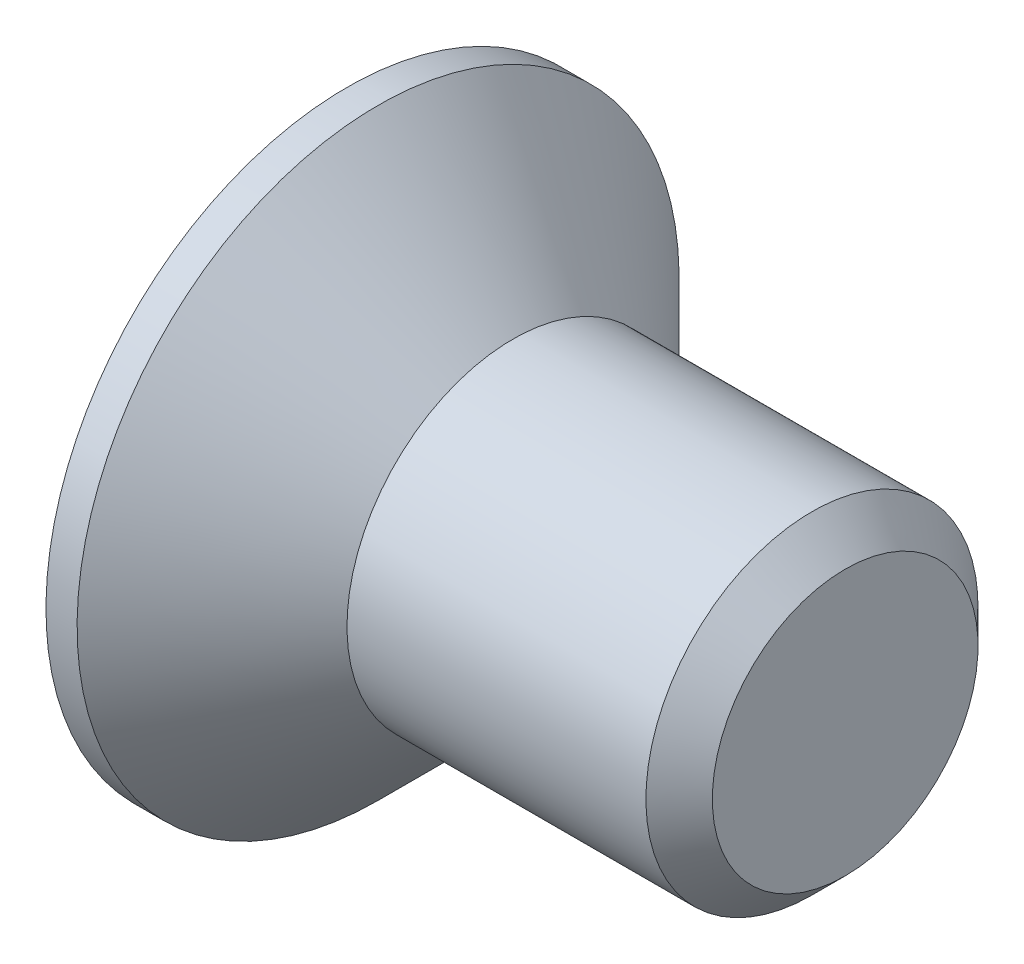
from build123d import *

# Parameters (mm, degrees)
CHAMFER1_SIZE      = 0.8
CUT_EXTRUDE1_DEPTH = 3.45


with BuildPart() as part:
    # Sketch1 → Revolve1 (revolve)
    with BuildSketch(Plane.XY, mode=Mode.PRIVATE) as revolve1_sk:
        Polygon((-4, 7.25), (-4, 0), (8, 0), (8, 4), (0, 4), (-3.25, 7.25), align=None)
    revolve(revolve1_sk.sketch.rotate(Axis((-4, 0, 0), (1, 0, 0)), 180), axis=Axis((-4, 0, 0), (1, 0, 0)))

    # Chamfer1
    chamfer1_edges = [part.edges().sort_by_distance(p)[0] for p in [
        (8, 4, 0),
    ]]
    chamfer(chamfer1_edges, length=CHAMFER1_SIZE)

    # Sketch2 → Cut-Extrude1 (cut)
    with BuildSketch(Plane.ZY.offset(4)):
        Polygon((-1.09, 4.35), (1.09, 4.35), (1.09, 1.09), (4.35, 1.09), (4.35, -1.09), (1.09, -1.09), (1.09, -4.35), (-1.09, -4.35), (-1.09, -1.09), (-4.35, -1.09), (-4.35, 1.09), (-1.09, 1.09), align=None)
    extrude(amount=-CUT_EXTRUDE1_DEPTH, mode=Mode.SUBTRACT)


solid = part.part
